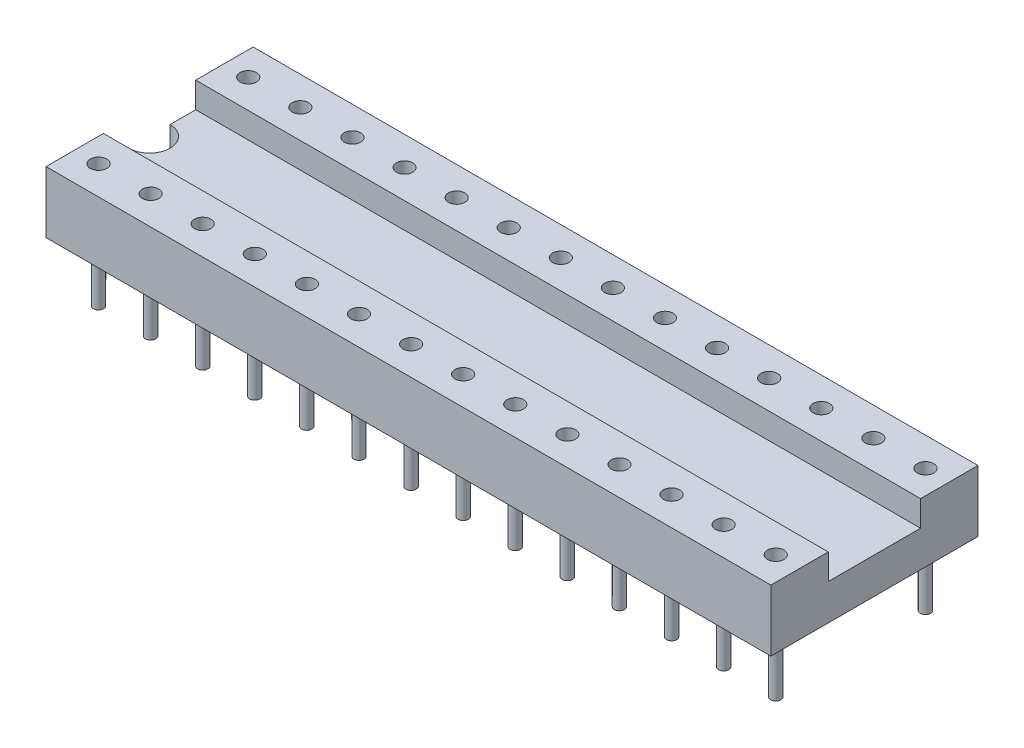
from build123d import *

# Parameters (mm, degrees)
EXTRUSION1_DEPTH        = 35.34
ENL_V_MAT_EXTRU_1_DEPTH = 36.741860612
ESQUISSE3_R             = 0.4
ENL_V_MAT_EXTRU_2_DEPTH = 2.5
ESQUISSE5_R             = 0.25
EXTRUSION2_DEPTH        = 3


with BuildPart() as part:
    # Esquisse1 → Extrusion1 (new body)
    with BuildSketch(Plane(origin=(0, 0, 0), x_dir=(0, 0, -1), z_dir=(1, 0, 0))):
        Polygon((-2.25, 1.75), (-2.25, 3), (-5.05, 3), (-5.05, 0), (5.05, 0), (5.05, 3), (2.25, 3), (2.25, 1.75), align=None)
    extrude(amount=EXTRUSION1_DEPTH)

    # Esquisse2 → Enl_v. mat.-Extru.1 (cut, through all)
    with BuildSketch(Plane(origin=(0, 1.75, 0), x_dir=(-1, 0, 0), z_dir=(0, 1, 0))):
        with BuildLine():
            Line((0, -1), (0, 1))
            ThreePointArc((0, 1), (-1, 0), (0, -1))
        make_face()
    extrude(amount=-ENL_V_MAT_EXTRU_1_DEPTH, mode=Mode.SUBTRACT)

    # Esquisse3 → Enl_v. mat.-Extru.2 (cut)
    with BuildSketch(Plane(origin=(0, 3, 0), x_dir=(-1, 0, 0), z_dir=(0, 1, 0))):
        with Locations(Location((-1.16, 3.65, 0), (0, 0, 90))):
            Circle(ESQUISSE3_R)
        with Locations(Location((-1.16, -3.65, 0), (0, 0, 270))):
            Circle(ESQUISSE3_R)
        with Locations(Location((-3.7, 3.65, 0), (0, 0, 90))):
            Circle(ESQUISSE3_R)
        with Locations(Location((-3.7, -3.65, 0), (0, 0, 270))):
            Circle(ESQUISSE3_R)
        with Locations(Location((-6.24, 3.65, 0), (0, 0, 90))):
            Circle(ESQUISSE3_R)
        with Locations(Location((-6.24, -3.65, 0), (0, 0, 270))):
            Circle(ESQUISSE3_R)
        with Locations(Location((-8.78, 3.65, 0), (0, 0, 90))):
            Circle(ESQUISSE3_R)
        with Locations(Location((-8.78, -3.65, 0), (0, 0, 270))):
            Circle(ESQUISSE3_R)
        with Locations(Location((-11.32, 3.65, 0), (0, 0, 90))):
            Circle(ESQUISSE3_R)
        with Locations(Location((-11.32, -3.65, 0), (0, 0, 270))):
            Circle(ESQUISSE3_R)
        with Locations(Location((-13.86, 3.65, 0), (0, 0, 90))):
            Circle(ESQUISSE3_R)
        with Locations(Location((-13.86, -3.65, 0), (0, 0, 270))):
            Circle(ESQUISSE3_R)
        with Locations(Location((-16.4, 3.65, 0), (0, 0, 90))):
            Circle(ESQUISSE3_R)
        with Locations(Location((-16.4, -3.65, 0), (0, 0, 270))):
            Circle(ESQUISSE3_R)
        with Locations(Location((-18.94, 3.65, 0), (0, 0, 90))):
            Circle(ESQUISSE3_R)
        with Locations(Location((-18.94, -3.65, 0), (0, 0, 270))):
            Circle(ESQUISSE3_R)
        with Locations(Location((-21.48, 3.65, 0), (0, 0, 90))):
            Circle(ESQUISSE3_R)
        with Locations(Location((-21.48, -3.65, 0), (0, 0, 270))):
            Circle(ESQUISSE3_R)
        with Locations(Location((-24.02, 3.65, 0), (0, 0, 90))):
            Circle(ESQUISSE3_R)
        with Locations(Location((-24.02, -3.65, 0), (0, 0, 270))):
            Circle(ESQUISSE3_R)
        with Locations(Location((-26.56, 3.65, 0), (0, 0, 90))):
            Circle(ESQUISSE3_R)
        with Locations(Location((-26.56, -3.65, 0), (0, 0, 270))):
            Circle(ESQUISSE3_R)
        with Locations(Location((-29.1, 3.65, 0), (0, 0, 90))):
            Circle(ESQUISSE3_R)
        with Locations(Location((-29.1, -3.65, 0), (0, 0, 270))):
            Circle(ESQUISSE3_R)
        with Locations(Location((-31.64, 3.65, 0), (0, 0, 90))):
            Circle(ESQUISSE3_R)
        with Locations(Location((-31.64, -3.65, 0), (0, 0, 270))):
            Circle(ESQUISSE3_R)
        with Locations(Location((-34.18, 3.65, 0), (0, 0, 90))):
            Circle(ESQUISSE3_R)
        with Locations(Location((-34.18, -3.65, 0), (0, 0, 270))):
            Circle(ESQUISSE3_R)
    extrude(amount=-ENL_V_MAT_EXTRU_2_DEPTH, mode=Mode.SUBTRACT)

    # Esquisse5 → Extrusion2 (add)
    with BuildSketch(Plane.XZ):
        with Locations(Location((1.16, 3.65, 0), (0, 0, 90))):
            Circle(ESQUISSE5_R)
        with Locations(Location((1.16, -3.65, 0), (0, 0, 90))):
            Circle(ESQUISSE5_R)
        with Locations(Location((3.7, -3.65, 0), (0, 0, 90))):
            Circle(ESQUISSE5_R)
        with Locations(Location((3.7, 3.65, 0), (0, 0, 90))):
            Circle(ESQUISSE5_R)
        with Locations(Location((6.24, -3.65, 0), (0, 0, 90))):
            Circle(ESQUISSE5_R)
        with Locations(Location((6.24, 3.65, 0), (0, 0, 90))):
            Circle(ESQUISSE5_R)
        with Locations(Location((8.78, -3.65, 0), (0, 0, 90))):
            Circle(ESQUISSE5_R)
        with Locations(Location((8.78, 3.65, 0), (0, 0, 90))):
            Circle(ESQUISSE5_R)
        with Locations(Location((11.32, -3.65, 0), (0, 0, 90))):
            Circle(ESQUISSE5_R)
        with Locations(Location((11.32, 3.65, 0), (0, 0, 90))):
            Circle(ESQUISSE5_R)
        with Locations(Location((13.86, -3.65, 0), (0, 0, 90))):
            Circle(ESQUISSE5_R)
        with Locations(Location((13.86, 3.65, 0), (0, 0, 90))):
            Circle(ESQUISSE5_R)
        with Locations(Location((16.4, -3.65, 0), (0, 0, 90))):
            Circle(ESQUISSE5_R)
        with Locations(Location((16.4, 3.65, 0), (0, 0, 90))):
            Circle(ESQUISSE5_R)
        with Locations(Location((18.94, -3.65, 0), (0, 0, 90))):
            Circle(ESQUISSE5_R)
        with Locations(Location((18.94, 3.65, 0), (0, 0, 90))):
            Circle(ESQUISSE5_R)
        with Locations(Location((21.48, -3.65, 0), (0, 0, 90))):
            Circle(ESQUISSE5_R)
        with Locations(Location((21.48, 3.65, 0), (0, 0, 90))):
            Circle(ESQUISSE5_R)
        with Locations(Location((24.02, -3.65, 0), (0, 0, 90))):
            Circle(ESQUISSE5_R)
        with Locations(Location((24.02, 3.65, 0), (0, 0, 90))):
            Circle(ESQUISSE5_R)
        with Locations(Location((26.56, -3.65, 0), (0, 0, 90))):
            Circle(ESQUISSE5_R)
        with Locations(Location((26.56, 3.65, 0), (0, 0, 90))):
            Circle(ESQUISSE5_R)
        with Locations(Location((29.1, -3.65, 0), (0, 0, 90))):
            Circle(ESQUISSE5_R)
        with Locations(Location((29.1, 3.65, 0), (0, 0, 90))):
            Circle(ESQUISSE5_R)
        with Locations(Location((31.64, -3.65, 0), (0, 0, 90))):
            Circle(ESQUISSE5_R)
        with Locations(Location((31.64, 3.65, 0), (0, 0, 90))):
            Circle(ESQUISSE5_R)
        with Locations(Location((34.18, -3.65, 0), (0, 0, 90))):
            Circle(ESQUISSE5_R)
        with Locations(Location((34.18, 3.65, 0), (0, 0, 90))):
            Circle(ESQUISSE5_R)
    extrude(amount=EXTRUSION2_DEPTH)


solid = part.part
